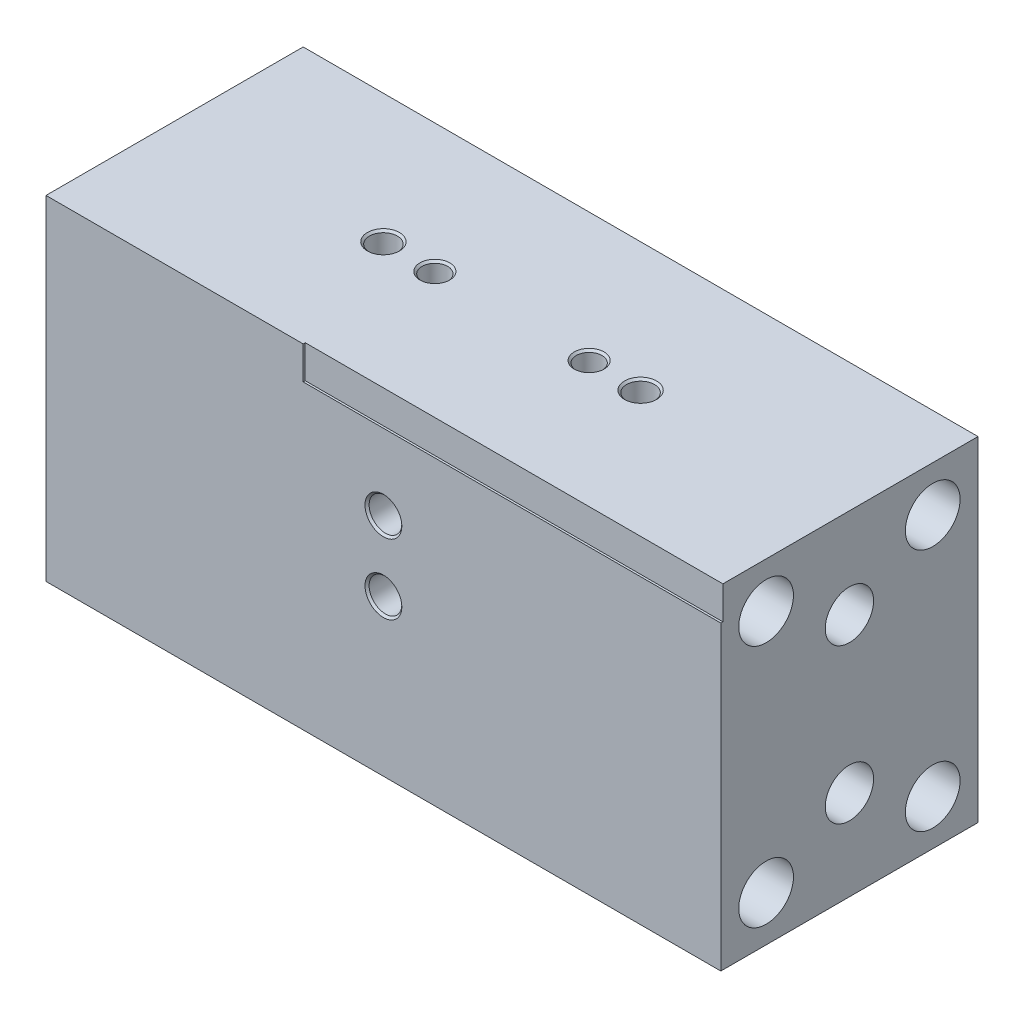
from build123d import *

# Parameters (mm, degrees)
SKETCH1_W                  = 83.312
SKETCH1_H                  = 41.275
EXTRUDE1_DEPTH             = 15.875
SKETCH18_W                 = 0.254
SKETCH18_H                 = 4.064
CUT_EXTRUDE1_DEPTH         = 51.562
F_8_32_TAPPED_HOLE1_D      = 3.4544
F_8_32_TAPPED_HOLE1_DEPTH  = 10.3124
F_8_32_TAPPED_HOLE1_TIP    = 1.037806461
HOLE1_D                    = 3.175
HOLE1_DEPTH                = 6.35
HOLE1_TIP                  = 0.953866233
F_10_32_TAPPED_HOLE1_D     = 4.0386
F_10_32_TAPPED_HOLE1_DEPTH = 9.5504
F_10_32_TAPPED_HOLE1_TIP   = 1.213317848
F_8_32_TAPPED_HOLE2_D      = 3.4544
F_8_32_TAPPED_HOLE2_DEPTH  = 10.3124
F_8_32_TAPPED_HOLE2_TIP    = 1.037806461
HOLE2_D                    = 3.175
HOLE2_DEPTH                = 6.35
HOLE2_TIP                  = 0.953866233
SKETCH29_R                 = 3.3782
SKETCH29_R_2               = 2.9845
CUT_EXTRUDE2_DEPTH         = 88.285802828
CHAMFER1_SIZE              = 0.254


with BuildPart() as part:
    # Sketch1 → Extrude1 (new, symmetric)
    with BuildSketch(Plane.XY):
        Rectangle(SKETCH1_W, SKETCH1_H)
    extrude(amount=EXTRUDE1_DEPTH, both=True)

    # Sketch18 → Cut-Extrude1 (cut)
    with BuildSketch(Plane(origin=(41.656, 0, 0), x_dir=(0, 0, -1), z_dir=(1, 0, 0))):
        with Locations((-15.748, 18.6055)):
            Rectangle(SKETCH18_W, SKETCH18_H)
    extrude(amount=-CUT_EXTRUDE1_DEPTH, mode=Mode.SUBTRACT)

    # 8-32 Tapped Hole1
    with Locations(Plane(origin=(0, 20.6375, 0), x_dir=(1, 0, 0), z_dir=(0, 1, 0))):
        with Locations((-15.875, 0), (15.875, 0)):
            Hole(F_8_32_TAPPED_HOLE1_D / 2, depth=F_8_32_TAPPED_HOLE1_DEPTH)
            with Locations((0, 0, -(F_8_32_TAPPED_HOLE1_DEPTH + F_8_32_TAPPED_HOLE1_TIP / 2))):  # 118° drill point
                Cone(0, F_8_32_TAPPED_HOLE1_D / 2, F_8_32_TAPPED_HOLE1_TIP, mode=Mode.SUBTRACT)

    # Hole1
    with Locations(Plane(origin=(0, 20.6375, 0), x_dir=(1, 0, 0), z_dir=(0, 1, 0))):
        with Locations((-9.525, 0), (9.525, 0)):
            Hole(HOLE1_D / 2, depth=HOLE1_DEPTH)
            with Locations((0, 0, -(HOLE1_DEPTH + HOLE1_TIP / 2))):  # 118° drill point
                Cone(0, HOLE1_D / 2, HOLE1_TIP, mode=Mode.SUBTRACT)

    # 10-32 Tapped Hole1
    with Locations(Plane.XY.offset(15.875)):
        with Locations((0, 7.239), (0, -1.397)):
            Hole(F_10_32_TAPPED_HOLE1_D / 2, depth=F_10_32_TAPPED_HOLE1_DEPTH)
            with Locations((0, 0, -(F_10_32_TAPPED_HOLE1_DEPTH + F_10_32_TAPPED_HOLE1_TIP / 2))):  # 118° drill point
                Cone(0, F_10_32_TAPPED_HOLE1_D / 2, F_10_32_TAPPED_HOLE1_TIP, mode=Mode.SUBTRACT)

    # 8-32 Tapped Hole2
    with Locations(Plane(origin=(0, 0, -15.875), x_dir=(-1, 0, 0), z_dir=(0, 0, -1))):
        with Locations((-15.875, 0), (15.875, 0)):
            Hole(F_8_32_TAPPED_HOLE2_D / 2, depth=F_8_32_TAPPED_HOLE2_DEPTH)
            with Locations((0, 0, -(F_8_32_TAPPED_HOLE2_DEPTH + F_8_32_TAPPED_HOLE2_TIP / 2))):  # 118° drill point
                Cone(0, F_8_32_TAPPED_HOLE2_D / 2, F_8_32_TAPPED_HOLE2_TIP, mode=Mode.SUBTRACT)

    # Hole2
    with Locations(Plane(origin=(0, 0, -15.875), x_dir=(-1, 0, 0), z_dir=(0, 0, -1))):
        with Locations((-9.525, 0), (9.525, 0)):
            Hole(HOLE2_D / 2, depth=HOLE2_DEPTH)
            with Locations((0, 0, -(HOLE2_DEPTH + HOLE2_TIP / 2))):  # 118° drill point
                Cone(0, HOLE2_D / 2, HOLE2_TIP, mode=Mode.SUBTRACT)

    # Sketch29 → Cut-Extrude2 (cut, through all)
    with BuildSketch(Plane(origin=(41.656, 0, 0), x_dir=(0, 0, -1), z_dir=(1, 0, 0))):
        with Locations((-10.287, 15.0495)):
            Circle(SKETCH29_R)
        with Locations((10.287, 15.0495)):
            Circle(SKETCH29_R)
        with Locations((-10.287, -15.0495)):
            Circle(SKETCH29_R)
        with Locations((10.287, -15.0495)):
            Circle(SKETCH29_R)
        with Locations((0, 9.525)):
            Circle(SKETCH29_R_2)
        with Locations((0, -9.525)):
            Circle(SKETCH29_R_2)
    extrude(amount=-CUT_EXTRUDE2_DEPTH, mode=Mode.SUBTRACT)

    # Chamfer1
    chamfer1_edges = [part.edges().sort_by_distance(p)[0] for p in [
        (17.6022, 20.6375, 0),
        (-14.1478, 20.6375, 0),
        (11.1125, 20.6375, 0),
        (-7.9375, 20.6375, 0),
        (2.0193, -1.397, 15.875),
        (2.0193, 7.239, 15.875),
        (-17.6022, 0, -15.875),
        (14.1478, 0, -15.875),
        (-11.1125, 0, -15.875),
        (7.9375, 0, -15.875),
    ]]
    chamfer(chamfer1_edges, length=CHAMFER1_SIZE)


solid = part.part
